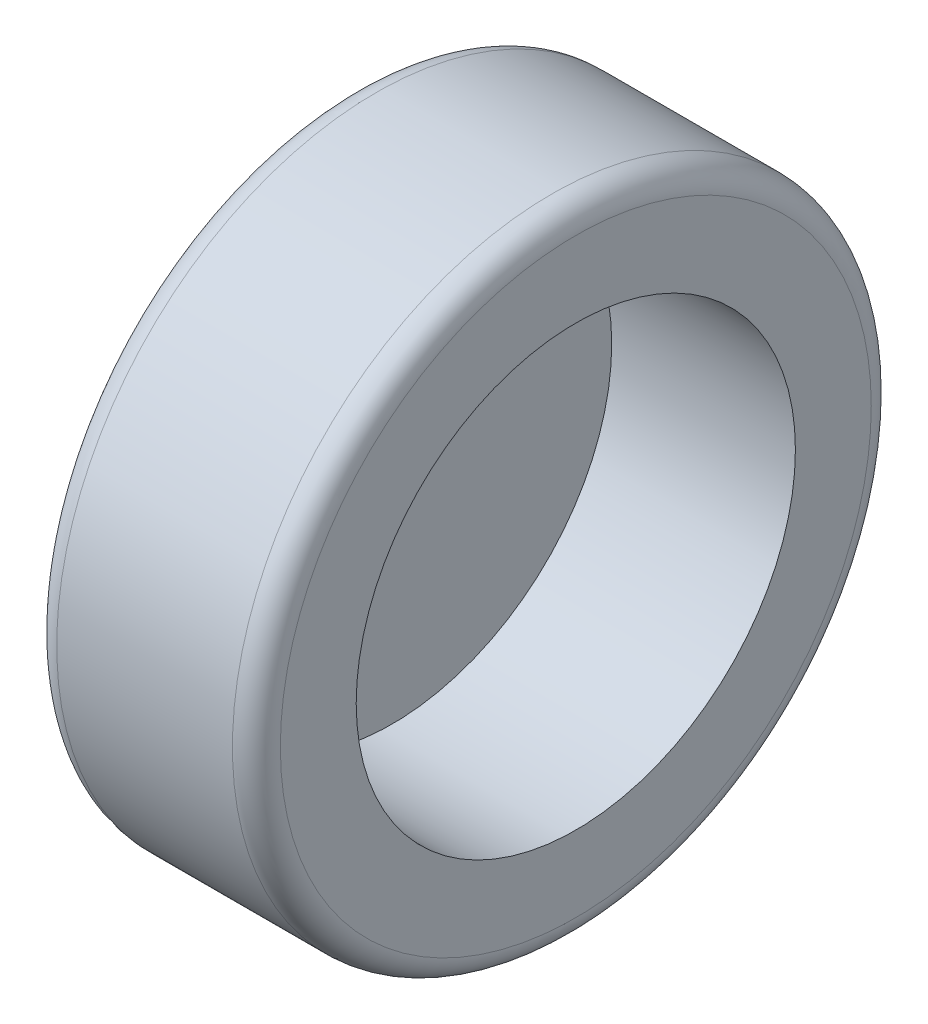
ISO-10303-21;
HEADER;
FILE_DESCRIPTION(('STEP AP214'),'2;1');
FILE_NAME('part.step','',(''),(''),'','','');
FILE_SCHEMA(('AUTOMOTIVE_DESIGN { 1 0 10303 214 1 1 1 1 }'));
ENDSEC;
DATA;
#1=APPLICATION_CONTEXT('core data for automotive mechanical design processes');
#2=APPLICATION_PROTOCOL_DEFINITION('international standard','automotive_design',2000,#1);
#3=PRODUCT_CONTEXT('',#1,'mechanical');
#4=PRODUCT('Part','Part','',(#3));
#5=PRODUCT_RELATED_PRODUCT_CATEGORY('part','',(#4));
#6=PRODUCT_DEFINITION_FORMATION('','',#4);
#7=PRODUCT_DEFINITION_CONTEXT('part definition',#1,'design');
#8=PRODUCT_DEFINITION('design','',#6,#7);
#9=PRODUCT_DEFINITION_SHAPE('','',#8);
#10=(LENGTH_UNIT() NAMED_UNIT(*) SI_UNIT(.MILLI.,.METRE.));
#11=(NAMED_UNIT(*) PLANE_ANGLE_UNIT() SI_UNIT($,.RADIAN.));
#12=(NAMED_UNIT(*) SI_UNIT($,.STERADIAN.) SOLID_ANGLE_UNIT());
#13=UNCERTAINTY_MEASURE_WITH_UNIT(LENGTH_MEASURE(1.E-05),#10,'distance_accuracy_value','');
#14=(GEOMETRIC_REPRESENTATION_CONTEXT(3) GLOBAL_UNCERTAINTY_ASSIGNED_CONTEXT((#13)) GLOBAL_UNIT_ASSIGNED_CONTEXT((#10,
#11,#12)) REPRESENTATION_CONTEXT('',''));
#15=CARTESIAN_POINT('',(0.,0.,0.));
#16=DIRECTION('',(0.,0.,1.));
#17=DIRECTION('',(1.,0.,0.));
#18=AXIS2_PLACEMENT_3D('',#15,#16,#17);
#19=CARTESIAN_POINT('',(140.,0.,0.));
#20=DIRECTION('',(-1.,0.,0.));
#21=DIRECTION('',(0.,0.,1.));
#22=AXIS2_PLACEMENT_3D('',#19,#20,#21);
#23=CYLINDRICAL_SURFACE('',#22,275.);
#24=CARTESIAN_POINT('',(140.,0.,0.));
#25=DIRECTION('',(1.,0.,0.));
#26=DIRECTION('',(0.,0.,-1.));
#27=AXIS2_PLACEMENT_3D('',#24,#25,#26);
#28=CIRCLE('',#27,275.);
#29=CARTESIAN_POINT('',(140.,0.,-275.));
#30=VERTEX_POINT('',#29);
#31=EDGE_CURVE('E53',#30,#30,#28,.T.);
#32=ORIENTED_EDGE('',*,*,#31,.T.);
#33=EDGE_LOOP('',(#32));
#34=FACE_BOUND('',#33,.T.);
#35=CARTESIAN_POINT('',(-90.,0.,0.));
#36=DIRECTION('',(-1.,0.,0.));
#37=DIRECTION('',(0.,0.,1.));
#38=AXIS2_PLACEMENT_3D('',#35,#36,#37);
#39=CIRCLE('',#38,275.);
#40=CARTESIAN_POINT('',(-90.,0.,275.));
#41=VERTEX_POINT('',#40);
#42=EDGE_CURVE('E54',#41,#41,#39,.T.);
#43=ORIENTED_EDGE('',*,*,#42,.T.);
#44=EDGE_LOOP('',(#43));
#45=FACE_BOUND('',#44,.T.);
#46=ADVANCED_FACE('F33',(#34,#45),#23,.F.);
#47=CARTESIAN_POINT('',(140.,0.,0.));
#48=DIRECTION('',(1.,0.,0.));
#49=DIRECTION('',(0.,0.,-1.));
#50=AXIS2_PLACEMENT_3D('',#47,#48,#49);
#51=PLANE('',#50);
#52=CARTESIAN_POINT('',(140.,0.,0.));
#53=DIRECTION('',(1.,0.,0.));
#54=DIRECTION('',(0.,0.,-1.));
#55=AXIS2_PLACEMENT_3D('',#52,#53,#54);
#56=CIRCLE('',#55,370.);
#57=CARTESIAN_POINT('',(140.,0.,-370.));
#58=VERTEX_POINT('',#57);
#59=EDGE_CURVE('E48',#58,#58,#56,.T.);
#60=ORIENTED_EDGE('',*,*,#59,.T.);
#61=EDGE_LOOP('',(#60));
#62=FACE_BOUND('',#61,.T.);
#63=ORIENTED_EDGE('',*,*,#31,.F.);
#64=EDGE_LOOP('',(#63));
#65=FACE_BOUND('',#64,.T.);
#66=ADVANCED_FACE('F79',(#62,#65),#51,.T.);
#67=CARTESIAN_POINT('',(-140.,0.,0.));
#68=DIRECTION('',(1.,0.,0.));
#69=DIRECTION('',(0.,0.,-1.));
#70=AXIS2_PLACEMENT_3D('',#67,#68,#69);
#71=PLANE('',#70);
#72=CARTESIAN_POINT('',(-140.,0.,0.));
#73=DIRECTION('',(1.,0.,0.));
#74=DIRECTION('',(0.,0.,-1.));
#75=AXIS2_PLACEMENT_3D('',#72,#73,#74);
#76=CIRCLE('',#75,370.);
#77=CARTESIAN_POINT('',(-140.,0.,-370.));
#78=VERTEX_POINT('',#77);
#79=EDGE_CURVE('E10',#78,#78,#76,.F.);
#80=ORIENTED_EDGE('',*,*,#79,.T.);
#81=EDGE_LOOP('',(#80));
#82=FACE_BOUND('',#81,.T.);
#83=CARTESIAN_POINT('',(-140.,0.,0.));
#84=DIRECTION('',(-1.,0.,0.));
#85=DIRECTION('',(0.,0.,1.));
#86=AXIS2_PLACEMENT_3D('',#83,#84,#85);
#87=CIRCLE('',#86,5.);
#88=CARTESIAN_POINT('',(-140.,0.,5.));
#89=VERTEX_POINT('',#88);
#90=EDGE_CURVE('E60',#89,#89,#87,.T.);
#91=ORIENTED_EDGE('',*,*,#90,.F.);
#92=EDGE_LOOP('',(#91));
#93=FACE_BOUND('',#92,.T.);
#94=ADVANCED_FACE('F76',(#82,#93),#71,.F.);
#95=CARTESIAN_POINT('',(140.,0.,0.));
#96=DIRECTION('',(-1.,0.,0.));
#97=DIRECTION('',(0.,0.,1.));
#98=AXIS2_PLACEMENT_3D('',#95,#96,#97);
#99=CYLINDRICAL_SURFACE('',#98,400.);
#100=CARTESIAN_POINT('',(110.,0.,0.));
#101=DIRECTION('',(1.,0.,0.));
#102=DIRECTION('',(0.,0.,-1.));
#103=AXIS2_PLACEMENT_3D('',#100,#101,#102);
#104=CIRCLE('',#103,400.);
#105=CARTESIAN_POINT('',(110.,0.,-400.));
#106=VERTEX_POINT('',#105);
#107=EDGE_CURVE('E40',#106,#106,#104,.F.);
#108=ORIENTED_EDGE('',*,*,#107,.T.);
#109=EDGE_LOOP('',(#108));
#110=FACE_BOUND('',#109,.T.);
#111=CARTESIAN_POINT('',(-110.,0.,0.));
#112=DIRECTION('',(1.,0.,0.));
#113=DIRECTION('',(0.,0.,-1.));
#114=AXIS2_PLACEMENT_3D('',#111,#112,#113);
#115=CIRCLE('',#114,400.);
#116=CARTESIAN_POINT('',(-110.,0.,-400.));
#117=VERTEX_POINT('',#116);
#118=EDGE_CURVE('E44',#117,#117,#115,.T.);
#119=ORIENTED_EDGE('',*,*,#118,.T.);
#120=EDGE_LOOP('',(#119));
#121=FACE_BOUND('',#120,.T.);
#122=ADVANCED_FACE('F78',(#110,#121),#99,.T.);
#123=CARTESIAN_POINT('',(-90.,0.,0.));
#124=DIRECTION('',(-1.,0.,0.));
#125=DIRECTION('',(0.,0.,1.));
#126=AXIS2_PLACEMENT_3D('',#123,#124,#125);
#127=PLANE('',#126);
#128=CARTESIAN_POINT('',(-90.,0.,0.));
#129=DIRECTION('',(-1.,0.,0.));
#130=DIRECTION('',(0.,0.,1.));
#131=AXIS2_PLACEMENT_3D('',#128,#129,#130);
#132=CIRCLE('',#131,5.);
#133=CARTESIAN_POINT('',(-90.,0.,5.));
#134=VERTEX_POINT('',#133);
#135=EDGE_CURVE('E57',#134,#134,#132,.T.);
#136=ORIENTED_EDGE('',*,*,#135,.T.);
#137=EDGE_LOOP('',(#136));
#138=FACE_BOUND('',#137,.T.);
#139=ORIENTED_EDGE('',*,*,#42,.F.);
#140=EDGE_LOOP('',(#139));
#141=FACE_BOUND('',#140,.T.);
#142=ADVANCED_FACE('F66',(#138,#141),#127,.F.);
#143=CARTESIAN_POINT('',(-90.,0.,0.));
#144=DIRECTION('',(-1.,0.,0.));
#145=DIRECTION('',(0.,0.,1.));
#146=AXIS2_PLACEMENT_3D('',#143,#144,#145);
#147=CYLINDRICAL_SURFACE('',#146,5.);
#148=ORIENTED_EDGE('',*,*,#135,.F.);
#149=EDGE_LOOP('',(#148));
#150=FACE_BOUND('',#149,.T.);
#151=ORIENTED_EDGE('',*,*,#90,.T.);
#152=EDGE_LOOP('',(#151));
#153=FACE_BOUND('',#152,.T.);
#154=ADVANCED_FACE('F69',(#150,#153),#147,.F.);
#155=CARTESIAN_POINT('',(110.,0.,0.));
#156=DIRECTION('',(1.,0.,0.));
#157=DIRECTION('',(0.,0.,-1.));
#158=AXIS2_PLACEMENT_3D('',#155,#156,#157);
#159=TOROIDAL_SURFACE('',#158,370.,30.);
#160=ORIENTED_EDGE('',*,*,#107,.F.);
#161=EDGE_LOOP('',(#160));
#162=FACE_BOUND('',#161,.T.);
#163=ORIENTED_EDGE('',*,*,#59,.F.);
#164=EDGE_LOOP('',(#163));
#165=FACE_BOUND('',#164,.T.);
#166=ADVANCED_FACE('F72',(#162,#165),#159,.T.);
#167=CARTESIAN_POINT('',(-110.,0.,0.));
#168=DIRECTION('',(1.,0.,0.));
#169=DIRECTION('',(0.,0.,-1.));
#170=AXIS2_PLACEMENT_3D('',#167,#168,#169);
#171=TOROIDAL_SURFACE('',#170,370.,30.);
#172=ORIENTED_EDGE('',*,*,#79,.F.);
#173=EDGE_LOOP('',(#172));
#174=FACE_BOUND('',#173,.T.);
#175=ORIENTED_EDGE('',*,*,#118,.F.);
#176=EDGE_LOOP('',(#175));
#177=FACE_BOUND('',#176,.T.);
#178=ADVANCED_FACE('F35',(#174,#177),#171,.T.);
#179=CLOSED_SHELL('',(#46,#66,#94,#122,#142,#154,#166,#178));
#180=MANIFOLD_SOLID_BREP('B2',#179);
#181=ADVANCED_BREP_SHAPE_REPRESENTATION('',(#18,#180),#14);
#182=SHAPE_DEFINITION_REPRESENTATION(#9,#181);
ENDSEC;
END-ISO-10303-21;
